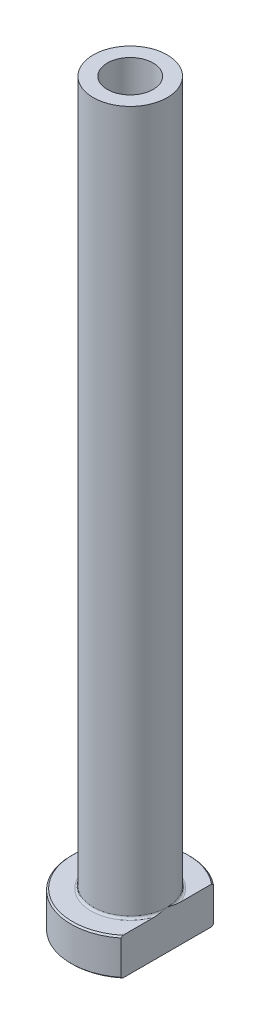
ISO-10303-21;
HEADER;
FILE_DESCRIPTION(('STEP AP214'),'2;1');
FILE_NAME('part.step','',(''),(''),'','','');
FILE_SCHEMA(('AUTOMOTIVE_DESIGN { 1 0 10303 214 1 1 1 1 }'));
ENDSEC;
DATA;
#1=APPLICATION_CONTEXT('core data for automotive mechanical design processes');
#2=APPLICATION_PROTOCOL_DEFINITION('international standard','automotive_design',2000,#1);
#3=PRODUCT_CONTEXT('',#1,'mechanical');
#4=PRODUCT('Part','Part','',(#3));
#5=PRODUCT_RELATED_PRODUCT_CATEGORY('part','',(#4));
#6=PRODUCT_DEFINITION_FORMATION('','',#4);
#7=PRODUCT_DEFINITION_CONTEXT('part definition',#1,'design');
#8=PRODUCT_DEFINITION('design','',#6,#7);
#9=PRODUCT_DEFINITION_SHAPE('','',#8);
#10=(LENGTH_UNIT() NAMED_UNIT(*) SI_UNIT(.MILLI.,.METRE.));
#11=(NAMED_UNIT(*) PLANE_ANGLE_UNIT() SI_UNIT($,.RADIAN.));
#12=(NAMED_UNIT(*) SI_UNIT($,.STERADIAN.) SOLID_ANGLE_UNIT());
#13=UNCERTAINTY_MEASURE_WITH_UNIT(LENGTH_MEASURE(1.E-05),#10,'distance_accuracy_value','');
#14=(GEOMETRIC_REPRESENTATION_CONTEXT(3) GLOBAL_UNCERTAINTY_ASSIGNED_CONTEXT((#13)) GLOBAL_UNIT_ASSIGNED_CONTEXT((#10,
#11,#12)) REPRESENTATION_CONTEXT('',''));
#15=CARTESIAN_POINT('',(0.,0.,0.));
#16=DIRECTION('',(0.,0.,1.));
#17=DIRECTION('',(1.,0.,0.));
#18=AXIS2_PLACEMENT_3D('',#15,#16,#17);
#19=CARTESIAN_POINT('',(0.,92.1876809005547,0.));
#20=DIRECTION('',(0.,1.,0.));
#21=DIRECTION('',(0.,0.,1.));
#22=AXIS2_PLACEMENT_3D('',#19,#20,#21);
#23=CYLINDRICAL_SURFACE('',#22,3.09999999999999);
#24=CARTESIAN_POINT('',(0.,100.,0.));
#25=DIRECTION('',(0.,1.,0.));
#26=DIRECTION('',(0.,0.,1.));
#27=AXIS2_PLACEMENT_3D('',#24,#25,#26);
#28=CIRCLE('',#27,3.09999999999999);
#29=CARTESIAN_POINT('',(0.,100.,3.09999999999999));
#30=VERTEX_POINT('',#29);
#31=EDGE_CURVE('E167',#30,#30,#28,.T.);
#32=ORIENTED_EDGE('',*,*,#31,.T.);
#33=EDGE_LOOP('',(#32));
#34=FACE_BOUND('',#33,.T.);
#35=CARTESIAN_POINT('',(0.,55.,0.));
#36=DIRECTION('',(0.,1.,0.));
#37=DIRECTION('',(0.,0.,1.));
#38=AXIS2_PLACEMENT_3D('',#35,#36,#37);
#39=CIRCLE('',#38,3.09999999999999);
#40=CARTESIAN_POINT('',(0.,55.,3.09999999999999));
#41=VERTEX_POINT('',#40);
#42=EDGE_CURVE('E170',#41,#41,#39,.T.);
#43=ORIENTED_EDGE('',*,*,#42,.F.);
#44=EDGE_LOOP('',(#43));
#45=FACE_BOUND('',#44,.T.);
#46=ADVANCED_FACE('F32',(#34,#45),#23,.F.);
#47=CARTESIAN_POINT('',(-3.09999999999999,100.,0.));
#48=DIRECTION('',(0.,1.,0.));
#49=DIRECTION('',(0.,0.,1.));
#50=AXIS2_PLACEMENT_3D('',#47,#48,#49);
#51=PLANE('',#50);
#52=CARTESIAN_POINT('',(0.,100.,0.));
#53=DIRECTION('',(0.,1.,0.));
#54=DIRECTION('',(0.,0.,1.));
#55=AXIS2_PLACEMENT_3D('',#52,#53,#54);
#56=CIRCLE('',#55,5.);
#57=CARTESIAN_POINT('',(0.,100.,5.));
#58=VERTEX_POINT('',#57);
#59=EDGE_CURVE('E174',#58,#58,#56,.T.);
#60=ORIENTED_EDGE('',*,*,#59,.T.);
#61=EDGE_LOOP('',(#60));
#62=FACE_BOUND('',#61,.T.);
#63=ORIENTED_EDGE('',*,*,#31,.F.);
#64=EDGE_LOOP('',(#63));
#65=FACE_BOUND('',#64,.T.);
#66=ADVANCED_FACE('F157',(#62,#65),#51,.T.);
#67=CARTESIAN_POINT('',(0.,92.1876809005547,0.));
#68=DIRECTION('',(0.,1.,0.));
#69=DIRECTION('',(0.,0.,1.));
#70=AXIS2_PLACEMENT_3D('',#67,#68,#69);
#71=CYLINDRICAL_SURFACE('',#70,5.);
#72=CARTESIAN_POINT('',(0.,5.3,0.));
#73=DIRECTION('',(0.,1.,0.));
#74=DIRECTION('',(0.,0.,1.));
#75=AXIS2_PLACEMENT_3D('',#72,#73,#74);
#76=CIRCLE('',#75,5.);
#77=CARTESIAN_POINT('',(5.,5.3,0.));
#78=VERTEX_POINT('',#77);
#79=EDGE_CURVE('E180',#78,#78,#76,.T.);
#80=ORIENTED_EDGE('',*,*,#79,.T.);
#81=EDGE_LOOP('',(#80));
#82=FACE_BOUND('',#81,.T.);
#83=ORIENTED_EDGE('',*,*,#59,.F.);
#84=EDGE_LOOP('',(#83));
#85=FACE_BOUND('',#84,.T.);
#86=ADVANCED_FACE('F162',(#82,#85),#71,.T.);
#87=CARTESIAN_POINT('',(-4.99999999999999,5.,0.));
#88=DIRECTION('',(0.,1.,0.));
#89=DIRECTION('',(0.,0.,1.));
#90=AXIS2_PLACEMENT_3D('',#87,#88,#89);
#91=PLANE('',#90);
#92=DIRECTION('',(0.,0.,1.));
#93=VECTOR('',#92,1.);
#94=CARTESIAN_POINT('',(5.,5.,0.));
#95=LINE('',#94,#93);
#96=CARTESIAN_POINT('',(5.,5.,-5.98665181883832));
#97=VERTEX_POINT('',#96);
#98=CARTESIAN_POINT('',(5.,5.,-1.75783958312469));
#99=VERTEX_POINT('',#98);
#100=EDGE_CURVE('E54',#97,#99,#95,.T.);
#101=ORIENTED_EDGE('',*,*,#100,.F.);
#102=CARTESIAN_POINT('',(0.,5.,0.));
#103=DIRECTION('',(0.,1.,0.));
#104=DIRECTION('',(0.,0.,1.));
#105=AXIS2_PLACEMENT_3D('',#102,#103,#104);
#106=CIRCLE('',#105,7.80000000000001);
#107=CARTESIAN_POINT('',(4.99999999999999,5.,5.98665181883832));
#108=VERTEX_POINT('',#107);
#109=EDGE_CURVE('E186',#97,#108,#106,.T.);
#110=ORIENTED_EDGE('',*,*,#109,.T.);
#111=CARTESIAN_POINT('',(5.,5.,1.75783958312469));
#112=VERTEX_POINT('',#111);
#113=EDGE_CURVE('E134',#112,#108,#95,.T.);
#114=ORIENTED_EDGE('',*,*,#113,.F.);
#115=CARTESIAN_POINT('',(0.,5.,0.));
#116=DIRECTION('',(0.,1.,0.));
#117=DIRECTION('',(0.,0.,1.));
#118=AXIS2_PLACEMENT_3D('',#115,#116,#117);
#119=CIRCLE('',#118,5.3);
#120=EDGE_CURVE('E183',#112,#99,#119,.F.);
#121=ORIENTED_EDGE('',*,*,#120,.T.);
#122=EDGE_LOOP('',(#101,#110,#114,#121));
#123=FACE_BOUND('',#122,.T.);
#124=ADVANCED_FACE('F197',(#123),#91,.T.);
#125=CARTESIAN_POINT('',(0.,92.1876809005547,0.));
#126=DIRECTION('',(0.,1.,0.));
#127=DIRECTION('',(0.,0.,1.));
#128=AXIS2_PLACEMENT_3D('',#125,#126,#127);
#129=CYLINDRICAL_SURFACE('',#128,7.99999999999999);
#130=DIRECTION('',(0.,-1.,0.));
#131=VECTOR('',#130,1.);
#132=CARTESIAN_POINT('',(4.99999999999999,100.,6.24499799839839));
#133=LINE('',#132,#131);
#134=CARTESIAN_POINT('',(4.99999999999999,4.80000000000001,6.24499799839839));
#135=VERTEX_POINT('',#134);
#136=CARTESIAN_POINT('',(4.99999999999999,0.200000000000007,6.24499799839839));
#137=VERTEX_POINT('',#136);
#138=EDGE_CURVE('E82',#135,#137,#133,.T.);
#139=ORIENTED_EDGE('',*,*,#138,.F.);
#140=CARTESIAN_POINT('',(0.,4.80000000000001,0.));
#141=DIRECTION('',(0.,1.,0.));
#142=DIRECTION('',(0.,0.,1.));
#143=AXIS2_PLACEMENT_3D('',#140,#141,#142);
#144=CIRCLE('',#143,7.99999999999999);
#145=CARTESIAN_POINT('',(5.,4.80000000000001,-6.24499799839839));
#146=VERTEX_POINT('',#145);
#147=EDGE_CURVE('E95',#135,#146,#144,.F.);
#148=ORIENTED_EDGE('',*,*,#147,.T.);
#149=DIRECTION('',(0.,-1.,0.));
#150=VECTOR('',#149,1.);
#151=CARTESIAN_POINT('',(5.,100.,-6.24499799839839));
#152=LINE('',#151,#150);
#153=CARTESIAN_POINT('',(5.,0.200000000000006,-6.24499799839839));
#154=VERTEX_POINT('',#153);
#155=EDGE_CURVE('E192',#146,#154,#152,.T.);
#156=ORIENTED_EDGE('',*,*,#155,.T.);
#157=CARTESIAN_POINT('',(0.,0.200000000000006,0.));
#158=DIRECTION('',(0.,-1.,0.));
#159=DIRECTION('',(0.,0.,-1.));
#160=AXIS2_PLACEMENT_3D('',#157,#158,#159);
#161=CIRCLE('',#160,7.99999999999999);
#162=EDGE_CURVE('E98',#154,#137,#161,.F.);
#163=ORIENTED_EDGE('',*,*,#162,.T.);
#164=EDGE_LOOP('',(#139,#148,#156,#163));
#165=FACE_BOUND('',#164,.T.);
#166=ADVANCED_FACE('F190',(#165),#129,.T.);
#167=CARTESIAN_POINT('',(-7.99999999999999,0.,0.));
#168=DIRECTION('',(0.,-1.,0.));
#169=DIRECTION('',(0.,0.,-1.));
#170=AXIS2_PLACEMENT_3D('',#167,#168,#169);
#171=PLANE('',#170);
#172=CARTESIAN_POINT('',(0.,0.,0.));
#173=DIRECTION('',(0.,-1.,0.));
#174=DIRECTION('',(0.,0.,-1.));
#175=AXIS2_PLACEMENT_3D('',#172,#173,#174);
#176=CIRCLE('',#175,3.84999999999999);
#177=CARTESIAN_POINT('',(0.,0.,-3.84999999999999));
#178=VERTEX_POINT('',#177);
#179=EDGE_CURVE('E40',#178,#178,#176,.F.);
#180=ORIENTED_EDGE('',*,*,#179,.T.);
#181=EDGE_LOOP('',(#180));
#182=FACE_BOUND('',#181,.T.);
#183=DIRECTION('',(0.,0.,-1.));
#184=VECTOR('',#183,1.);
#185=CARTESIAN_POINT('',(4.99999999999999,0.,6.24499799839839));
#186=LINE('',#185,#184);
#187=CARTESIAN_POINT('',(4.99999999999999,0.,5.9866518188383));
#188=VERTEX_POINT('',#187);
#189=CARTESIAN_POINT('',(5.,0.,-5.98665181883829));
#190=VERTEX_POINT('',#189);
#191=EDGE_CURVE('E47',#188,#190,#186,.T.);
#192=ORIENTED_EDGE('',*,*,#191,.F.);
#193=CARTESIAN_POINT('',(0.,0.,0.));
#194=DIRECTION('',(0.,-1.,0.));
#195=DIRECTION('',(0.,0.,-1.));
#196=AXIS2_PLACEMENT_3D('',#193,#194,#195);
#197=CIRCLE('',#196,7.79999999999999);
#198=EDGE_CURVE('E92',#188,#190,#197,.T.);
#199=ORIENTED_EDGE('',*,*,#198,.T.);
#200=EDGE_LOOP('',(#192,#199));
#201=FACE_BOUND('',#200,.T.);
#202=ADVANCED_FACE('F91',(#182,#201),#171,.T.);
#203=CARTESIAN_POINT('',(0.,92.1876809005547,0.));
#204=DIRECTION('',(0.,1.,0.));
#205=DIRECTION('',(0.,0.,1.));
#206=AXIS2_PLACEMENT_3D('',#203,#204,#205);
#207=CYLINDRICAL_SURFACE('',#206,3.34999999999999);
#208=CARTESIAN_POINT('',(0.,0.5,0.));
#209=DIRECTION('',(0.,-1.,0.));
#210=DIRECTION('',(0.,0.,-1.));
#211=AXIS2_PLACEMENT_3D('',#208,#209,#210);
#212=CIRCLE('',#211,3.34999999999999);
#213=CARTESIAN_POINT('',(0.,0.5,-3.34999999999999));
#214=VERTEX_POINT('',#213);
#215=EDGE_CURVE('E11',#214,#214,#212,.T.);
#216=ORIENTED_EDGE('',*,*,#215,.T.);
#217=EDGE_LOOP('',(#216));
#218=FACE_BOUND('',#217,.T.);
#219=CARTESIAN_POINT('',(0.,43.,0.));
#220=DIRECTION('',(0.,1.,0.));
#221=DIRECTION('',(0.,0.,1.));
#222=AXIS2_PLACEMENT_3D('',#219,#220,#221);
#223=CIRCLE('',#222,3.35);
#224=CARTESIAN_POINT('',(0.,43.,3.35));
#225=VERTEX_POINT('',#224);
#226=EDGE_CURVE('E172',#225,#225,#223,.T.);
#227=ORIENTED_EDGE('',*,*,#226,.T.);
#228=EDGE_LOOP('',(#227));
#229=FACE_BOUND('',#228,.T.);
#230=ADVANCED_FACE('F215',(#218,#229),#207,.F.);
#231=CARTESIAN_POINT('',(0.,43.,0.));
#232=DIRECTION('',(0.,-1.,0.));
#233=DIRECTION('',(0.,0.,-1.));
#234=AXIS2_PLACEMENT_3D('',#231,#232,#233);
#235=CONICAL_SURFACE('',#234,3.35,0.0208303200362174);
#236=ORIENTED_EDGE('',*,*,#42,.T.);
#237=EDGE_LOOP('',(#236));
#238=FACE_BOUND('',#237,.T.);
#239=ORIENTED_EDGE('',*,*,#226,.F.);
#240=EDGE_LOOP('',(#239));
#241=FACE_BOUND('',#240,.T.);
#242=ADVANCED_FACE('F111',(#238,#241),#235,.F.);
#243=CARTESIAN_POINT('',(0.,5.3,0.));
#244=DIRECTION('',(0.,1.,0.));
#245=DIRECTION('',(0.,0.,1.));
#246=AXIS2_PLACEMENT_3D('',#243,#244,#245);
#247=TOROIDAL_SURFACE('',#246,5.3,0.3);
#248=ORIENTED_EDGE('',*,*,#120,.F.);
#249=CARTESIAN_POINT('',(5.,5.3,0.));
#250=CARTESIAN_POINT('',(5.,5.30000062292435,-1.31469035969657E-10));
#251=CARTESIAN_POINT('',(5.,5.30000124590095,2.52759224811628E-07));
#252=CARTESIAN_POINT('',(5.,5.30000240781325,9.47164356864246E-07));
#253=CARTESIAN_POINT('',(5.,5.30000293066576,1.40594039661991E-06));
#254=CARTESIAN_POINT('',(5.,5.30000402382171,2.50637608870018E-06));
#255=CARTESIAN_POINT('',(5.,5.30000457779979,3.1658891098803E-06));
#256=CARTESIAN_POINT('',(5.,5.30000556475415,4.52859968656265E-06));
#257=CARTESIAN_POINT('',(5.,5.30000600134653,5.22939450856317E-06));
#258=CARTESIAN_POINT('',(5.,5.30000763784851,7.96121989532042E-06));
#259=CARTESIAN_POINT('',(5.,5.30000875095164,1.00477409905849E-05));
#260=CARTESIAN_POINT('',(5.,5.30001056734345,1.41660874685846E-05));
#261=CARTESIAN_POINT('',(5.,5.30001129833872,1.61861784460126E-05));
#262=CARTESIAN_POINT('',(5.,5.3000143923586,2.47865742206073E-05));
#263=CARTESIAN_POINT('',(5.,5.30001672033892,3.13830284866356E-05));
#264=CARTESIAN_POINT('',(5.,5.3000201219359,4.38084221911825E-05));
#265=CARTESIAN_POINT('',(5.,5.30002133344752,4.95992740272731E-05));
#266=CARTESIAN_POINT('',(5.,5.30003020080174,9.27862615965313E-05));
#267=CARTESIAN_POINT('',(5.,5.30003696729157,0.000130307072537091));
#268=CARTESIAN_POINT('',(5.,5.30006659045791,0.000278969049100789));
#269=CARTESIAN_POINT('',(5.,5.30009481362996,0.000389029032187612));
#270=CARTESIAN_POINT('',(5.,5.30020506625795,0.000826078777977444));
#271=CARTESIAN_POINT('',(5.,5.30028365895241,0.00115365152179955));
#272=CARTESIAN_POINT('',(5.,5.30059919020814,0.00245925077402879));
#273=CARTESIAN_POINT('',(5.,5.3008404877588,0.00343651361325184));
#274=CARTESIAN_POINT('',(5.,5.30184626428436,0.00752058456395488));
#275=CARTESIAN_POINT('',(5.,5.30260525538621,0.0106283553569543));
#276=CARTESIAN_POINT('',(5.,5.30996461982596,0.0407482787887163));
#277=CARTESIAN_POINT('',(5.,5.3165898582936,0.0677561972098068));
#278=CARTESIAN_POINT('',(5.,5.32953319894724,0.120688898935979));
#279=CARTESIAN_POINT('',(5.,5.33585289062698,0.146613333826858));
#280=CARTESIAN_POINT('',(5.,5.34926050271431,0.201795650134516));
#281=CARTESIAN_POINT('',(5.,5.35634306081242,0.231054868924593));
#282=CARTESIAN_POINT('',(5.,5.37050252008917,0.289917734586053));
#283=CARTESIAN_POINT('',(5.,5.37757848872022,0.319521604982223));
#284=CARTESIAN_POINT('',(5.,5.39452602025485,0.391032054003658));
#285=CARTESIAN_POINT('',(5.,5.40434071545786,0.432952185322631));
#286=CARTESIAN_POINT('',(5.,5.42340141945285,0.515763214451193));
#287=CARTESIAN_POINT('',(5.,5.4326555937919,0.556652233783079));
#288=CARTESIAN_POINT('',(5.,5.4571055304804,0.667075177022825));
#289=CARTESIAN_POINT('',(5.,5.47194176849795,0.736689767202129));
#290=CARTESIAN_POINT('',(5.,5.50018229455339,0.876836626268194));
#291=CARTESIAN_POINT('',(5.,5.51357312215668,0.947371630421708));
#292=CARTESIAN_POINT('',(5.,5.5393092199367,1.09497328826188));
#293=CARTESIAN_POINT('',(5.,5.5514621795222,1.17207432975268));
#294=CARTESIAN_POINT('',(5.,5.57239669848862,1.32672649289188));
#295=CARTESIAN_POINT('',(5.,5.58117877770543,1.40427754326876));
#296=CARTESIAN_POINT('',(5.,5.59499725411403,1.56873827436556));
#297=CARTESIAN_POINT('',(5.,5.59948802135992,1.65570044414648));
#298=CARTESIAN_POINT('',(5.,5.60018885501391,1.78535304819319));
#299=CARTESIAN_POINT('',(5.,5.59945214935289,1.82802575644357));
#300=CARTESIAN_POINT('',(5.,5.59559364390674,1.91325081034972));
#301=CARTESIAN_POINT('',(5.,5.59247319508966,1.95580321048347));
#302=CARTESIAN_POINT('',(5.,5.58383242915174,2.03512365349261));
#303=CARTESIAN_POINT('',(5.,5.57867386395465,2.07192937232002));
#304=CARTESIAN_POINT('',(5.,5.56543793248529,2.14526756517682));
#305=CARTESIAN_POINT('',(5.,5.55734203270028,2.18179676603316));
#306=CARTESIAN_POINT('',(5.,5.53718005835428,2.25427226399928));
#307=CARTESIAN_POINT('',(5.,5.52507057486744,2.29020746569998));
#308=CARTESIAN_POINT('',(5.,5.50270928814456,2.34223029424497));
#309=CARTESIAN_POINT('',(5.,5.4945781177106,2.35922314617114));
#310=CARTESIAN_POINT('',(5.,5.47657809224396,2.39224900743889));
#311=CARTESIAN_POINT('',(5.,5.46671281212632,2.40828390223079));
#312=CARTESIAN_POINT('',(5.,5.446958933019,2.43579467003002));
#313=CARTESIAN_POINT('',(5.,5.43745879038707,2.4475459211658));
#314=CARTESIAN_POINT('',(5.,5.41677914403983,2.46946476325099));
#315=CARTESIAN_POINT('',(5.,5.40560543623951,2.47963758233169));
#316=CARTESIAN_POINT('',(5.,5.38617750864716,2.49393642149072));
#317=CARTESIAN_POINT('',(5.,5.37851643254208,2.49886271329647));
#318=CARTESIAN_POINT('',(5.,5.36252740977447,2.50749953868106));
#319=CARTESIAN_POINT('',(5.,5.35419984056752,2.51121075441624));
#320=CARTESIAN_POINT('',(5.,5.33690648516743,2.51712941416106));
#321=CARTESIAN_POINT('',(5.,5.32793451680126,2.5193192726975));
#322=CARTESIAN_POINT('',(5.,5.30973576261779,2.52185978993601));
#323=CARTESIAN_POINT('',(5.,5.30050931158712,2.52221275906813));
#324=CARTESIAN_POINT('',(5.,5.28349166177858,2.52112455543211));
#325=CARTESIAN_POINT('',(5.,5.27568322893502,2.51993178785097));
#326=CARTESIAN_POINT('',(5.,5.26036860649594,2.51628294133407));
#327=CARTESIAN_POINT('',(5.,5.25286261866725,2.5138260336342));
#328=CARTESIAN_POINT('',(5.,5.23590266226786,2.50685484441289));
#329=CARTESIAN_POINT('',(5.,5.22661875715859,2.5019298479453));
#330=CARTESIAN_POINT('',(5.,5.2089551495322,2.49066548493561));
#331=CARTESIAN_POINT('',(5.,5.20057756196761,2.4843229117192));
#332=CARTESIAN_POINT('',(5.,5.17987008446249,2.46645212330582));
#333=CARTESIAN_POINT('',(5.,5.16824151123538,2.45411867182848));
#334=CARTESIAN_POINT('',(5.,5.14692461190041,2.42790849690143));
#335=CARTESIAN_POINT('',(5.,5.13723987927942,2.41402898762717));
#336=CARTESIAN_POINT('',(5.,5.11080706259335,2.37143175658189));
#337=CARTESIAN_POINT('',(5.,5.09628770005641,2.34134703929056));
#338=CARTESIAN_POINT('',(5.,5.07130349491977,2.27940731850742));
#339=CARTESIAN_POINT('',(5.,5.06087110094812,2.24754035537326));
#340=CARTESIAN_POINT('',(5.,5.03890359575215,2.1678724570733));
#341=CARTESIAN_POINT('',(5.,5.0291352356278,2.11959065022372));
#342=CARTESIAN_POINT('',(5.,5.01416953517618,2.02224928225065));
#343=CARTESIAN_POINT('',(5.,5.00898637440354,1.97318778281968));
#344=CARTESIAN_POINT('',(5.,5.00220823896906,1.87635767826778));
#345=CARTESIAN_POINT('',(5.,5.00050709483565,1.82859609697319));
#346=CARTESIAN_POINT('',(5.,4.99969104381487,1.7333016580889));
#347=CARTESIAN_POINT('',(5.,5.00056327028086,1.68576884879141));
#348=CARTESIAN_POINT('',(5.,5.00484296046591,1.57937770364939));
#349=CARTESIAN_POINT('',(5.,5.00880932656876,1.52054285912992));
#350=CARTESIAN_POINT('',(5.,5.01925964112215,1.40312974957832));
#351=CARTESIAN_POINT('',(5.,5.02574264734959,1.34455139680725));
#352=CARTESIAN_POINT('',(5.,5.04090087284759,1.22627662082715));
#353=CARTESIAN_POINT('',(5.,5.04962425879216,1.16658647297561));
#354=CARTESIAN_POINT('',(5.,5.06877923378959,1.04732463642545));
#355=CARTESIAN_POINT('',(5.,5.07921523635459,0.987753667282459));
#356=CARTESIAN_POINT('',(5.,5.10551698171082,0.846936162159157));
#357=CARTESIAN_POINT('',(5.,5.12196565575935,0.765799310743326));
#358=CARTESIAN_POINT('',(5.,5.15639716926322,0.604819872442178));
#359=CARTESIAN_POINT('',(5.,5.17436050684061,0.524973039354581));
#360=CARTESIAN_POINT('',(5.,5.20921667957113,0.374726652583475));
#361=CARTESIAN_POINT('',(5.,5.22599388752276,0.304300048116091));
#362=CARTESIAN_POINT('',(5.,5.25191105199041,0.196907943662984));
#363=CARTESIAN_POINT('',(5.,5.26090146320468,0.159905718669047));
#364=CARTESIAN_POINT('',(5.,5.2788185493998,0.0865164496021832));
#365=CARTESIAN_POINT('',(5.,5.28774391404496,0.0501291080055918));
#366=CARTESIAN_POINT('',(5.,5.2973962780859,0.0106218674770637));
#367=CARTESIAN_POINT('',(5.,5.29815688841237,0.00750762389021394));
#368=CARTESIAN_POINT('',(5.,5.29916304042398,0.0034220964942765));
#369=CARTESIAN_POINT('',(5.,5.29940309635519,0.00244985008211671));
#370=CARTESIAN_POINT('',(5.,5.29971711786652,0.00115049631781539));
#371=CARTESIAN_POINT('',(5.,5.29979541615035,0.000824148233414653));
#372=CARTESIAN_POINT('',(5.,5.29990531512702,0.000388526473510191));
#373=CARTESIAN_POINT('',(5.,5.29993348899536,0.000278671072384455));
#374=CARTESIAN_POINT('',(5.,5.29996306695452,0.000130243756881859));
#375=CARTESIAN_POINT('',(5.,5.29996982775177,9.27511380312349E-05));
#376=CARTESIAN_POINT('',(5.,5.29997868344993,4.95929890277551E-05));
#377=CARTESIAN_POINT('',(5.,5.29997989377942,4.38036556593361E-05));
#378=CARTESIAN_POINT('',(5.,5.29998329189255,3.13814186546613E-05));
#379=CARTESIAN_POINT('',(5.,5.29998561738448,2.47865220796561E-05));
#380=CARTESIAN_POINT('',(5.,5.29998870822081,1.61877547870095E-05));
#381=CARTESIAN_POINT('',(5.,5.29998943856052,1.416777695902E-05));
#382=CARTESIAN_POINT('',(5.,5.29999125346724,1.00495531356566E-05));
#383=CARTESIAN_POINT('',(5.,5.29999236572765,7.96302663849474E-06));
#384=CARTESIAN_POINT('',(5.,5.29999400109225,5.23107421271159E-06));
#385=CARTESIAN_POINT('',(5.,5.29999443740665,4.53021037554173E-06));
#386=CARTESIAN_POINT('',(5.,5.29999542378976,3.16731158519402E-06));
#387=CARTESIAN_POINT('',(5.,5.2999959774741,2.5076772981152E-06));
#388=CARTESIAN_POINT('',(5.,5.29999707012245,1.40695881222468E-06));
#389=CARTESIAN_POINT('',(5.,5.2999975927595,9.48032462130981E-07));
#390=CARTESIAN_POINT('',(5.,5.29999875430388,2.53244333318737E-07));
#391=CARTESIAN_POINT('',(5.,5.29999937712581,1.31459837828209E-10));
#392=CARTESIAN_POINT('',(5.,5.3,0.));
#393=B_SPLINE_CURVE_WITH_KNOTS('',3,(#249,#250,#251,#252,#253,#254,#255,#256,#257,#258,#259,
#260,#261,#262,#263,#264,#265,#266,#267,#268,#269,#270,#271,#272,#273,#274,#275,#276,#277,#278,
#279,#280,#281,#282,#283,#284,#285,#286,#287,#288,#289,#290,#291,#292,#293,#294,#295,#296,#297,
#298,#299,#300,#301,#302,#303,#304,#305,#306,#307,#308,#309,#310,#311,#312,#313,#314,#315,#316,
#317,#318,#319,#320,#321,#322,#323,#324,#325,#326,#327,#328,#329,#330,#331,#332,#333,#334,#335,
#336,#337,#338,#339,#340,#341,#342,#343,#344,#345,#346,#347,#348,#349,#350,#351,#352,#353,#354,
#355,#356,#357,#358,#359,#360,#361,#362,#363,#364,#365,#366,#367,#368,#369,#370,#371,#372,#373,
#374,#375,#376,#377,#378,#379,#380,#381,#382,#383,#384,#385,#386,#387,#388,#389,#390,#391,#392),
.UNSPECIFIED.,.T.,.F.,(4,2,2,2,2,2,2,2,2,2,2,2,2,2,2,2,2,2,2,2,2,2,2,2,2,2,2,2,2,2,2,2,2,2,2,2,
2,2,2,2,2,2,2,2,2,2,2,2,2,2,2,2,2,2,2,2,2,2,2,2,2,2,2,2,2,2,2,2,2,2,2,4),(0.,
1.88939299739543E-06,3.98058885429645E-06,6.54818524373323E-06,9.02404341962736E-06,
1.6093874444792E-05,2.25328191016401E-05,4.34843914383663E-05,6.12120190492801E-05,
0.00017562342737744,0.000516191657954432,0.00152710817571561,0.00454656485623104,
0.0141443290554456,0.0975679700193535,0.177619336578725,0.267931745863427,0.359245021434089,
0.488405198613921,0.61417378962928,0.827694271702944,1.04305715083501,1.27715608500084,
1.51121890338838,1.77214751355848,1.90013509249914,2.02805018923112,2.13945459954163,
2.25157451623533,2.36494894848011,2.42139235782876,2.4777207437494,2.52293802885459,
2.56800219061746,2.59524342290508,2.62246933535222,2.65000494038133,2.67750590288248,
2.7010894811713,2.72468854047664,2.75603978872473,2.78746268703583,2.83802806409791,
2.88868607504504,2.98834295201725,3.08877575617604,3.23618650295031,3.38405153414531,
3.52733651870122,3.66990630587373,3.84673903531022,4.02350562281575,4.20444776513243,
4.38586374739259,4.63419556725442,4.87971270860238,5.09690175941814,5.2111388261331,
5.32353360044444,5.3331513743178,5.33615533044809,5.33716246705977,5.33750240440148,
5.33761672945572,5.33763445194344,5.33765539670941,5.33766183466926,5.33766890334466,
5.33767137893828,5.33767394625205,5.33767603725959,5.33767792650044),.UNSPECIFIED.);
#394=EDGE_CURVE('E126',#112,#78,#393,.T.);
#395=ORIENTED_EDGE('',*,*,#394,.T.);
#396=ORIENTED_EDGE('',*,*,#79,.F.);
#397=CARTESIAN_POINT('',(5.,5.3,0.));
#398=CARTESIAN_POINT('',(5.,5.29999937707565,1.31470316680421E-10));
#399=CARTESIAN_POINT('',(5.,5.29999875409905,-2.52759223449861E-07));
#400=CARTESIAN_POINT('',(5.,5.29999759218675,-9.47164355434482E-07));
#401=CARTESIAN_POINT('',(5.,5.29999706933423,-1.4059403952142E-06));
#402=CARTESIAN_POINT('',(5.,5.29999597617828,-2.50637608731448E-06));
#403=CARTESIAN_POINT('',(5.,5.29999542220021,-3.16588910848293E-06));
#404=CARTESIAN_POINT('',(5.,5.29999443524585,-4.52859968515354E-06));
#405=CARTESIAN_POINT('',(5.,5.29999399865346,-5.22939450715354E-06));
#406=CARTESIAN_POINT('',(5.,5.29999236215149,-7.96121989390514E-06));
#407=CARTESIAN_POINT('',(5.,5.29999124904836,-1.00477409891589E-05));
#408=CARTESIAN_POINT('',(5.,5.29998943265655,-1.41660874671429E-05));
#409=CARTESIAN_POINT('',(5.,5.29998870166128,-1.61861784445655E-05));
#410=CARTESIAN_POINT('',(5.,5.2999856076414,-2.47865742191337E-05));
#411=CARTESIAN_POINT('',(5.,5.29998327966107,-3.1383028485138E-05));
#412=CARTESIAN_POINT('',(5.,5.2999798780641,-4.38084221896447E-05));
#413=CARTESIAN_POINT('',(5.,5.29997866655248,-4.95992740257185E-05));
#414=CARTESIAN_POINT('',(5.,5.29996979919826,-9.27862615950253E-05));
#415=CARTESIAN_POINT('',(5.,5.29996303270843,-0.000130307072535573));
#416=CARTESIAN_POINT('',(5.,5.29993340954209,-0.000278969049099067));
#417=CARTESIAN_POINT('',(5.,5.29990518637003,-0.000389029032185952));
#418=CARTESIAN_POINT('',(5.,5.29979493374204,-0.000826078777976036));
#419=CARTESIAN_POINT('',(5.,5.29971634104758,-0.00115365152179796));
#420=CARTESIAN_POINT('',(5.,5.29940080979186,-0.00245925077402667));
#421=CARTESIAN_POINT('',(5.,5.29915951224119,-0.0034365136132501));
#422=CARTESIAN_POINT('',(5.,5.29815373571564,-0.00752058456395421));
#423=CARTESIAN_POINT('',(5.,5.29739474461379,-0.0106283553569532));
#424=CARTESIAN_POINT('',(5.,5.29003538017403,-0.0407482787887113));
#425=CARTESIAN_POINT('',(5.,5.2834101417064,-0.0677561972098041));
#426=CARTESIAN_POINT('',(5.,5.27046680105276,-0.120688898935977));
#427=CARTESIAN_POINT('',(5.,5.26414710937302,-0.146613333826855));
#428=CARTESIAN_POINT('',(5.,5.25073949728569,-0.201795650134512));
#429=CARTESIAN_POINT('',(5.,5.24365693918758,-0.23105486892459));
#430=CARTESIAN_POINT('',(5.,5.22949747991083,-0.28991773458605));
#431=CARTESIAN_POINT('',(5.,5.22242151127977,-0.319521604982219));
#432=CARTESIAN_POINT('',(5.,5.20547397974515,-0.391032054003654));
#433=CARTESIAN_POINT('',(5.,5.19565928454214,-0.432952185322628));
#434=CARTESIAN_POINT('',(5.,5.17659858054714,-0.515763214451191));
#435=CARTESIAN_POINT('',(5.,5.1673444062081,-0.556652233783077));
#436=CARTESIAN_POINT('',(5.,5.1428944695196,-0.667075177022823));
#437=CARTESIAN_POINT('',(5.,5.12805823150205,-0.736689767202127));
#438=CARTESIAN_POINT('',(5.,5.09981770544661,-0.876836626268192));
#439=CARTESIAN_POINT('',(5.,5.08642687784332,-0.947371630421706));
#440=CARTESIAN_POINT('',(5.,5.0606907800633,-1.09497328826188));
#441=CARTESIAN_POINT('',(5.,5.04853782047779,-1.17207432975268));
#442=CARTESIAN_POINT('',(5.,5.02760330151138,-1.32672649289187));
#443=CARTESIAN_POINT('',(5.,5.01882122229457,-1.40427754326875));
#444=CARTESIAN_POINT('',(5.,5.00500274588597,-1.56873827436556));
#445=CARTESIAN_POINT('',(5.,5.00051197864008,-1.65570044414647));
#446=CARTESIAN_POINT('',(5.,4.99981114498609,-1.78535304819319));
#447=CARTESIAN_POINT('',(5.,5.0005478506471,-1.82802575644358));
#448=CARTESIAN_POINT('',(5.,5.00440635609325,-1.91325081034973));
#449=CARTESIAN_POINT('',(5.,5.00752680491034,-1.95580321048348));
#450=CARTESIAN_POINT('',(5.,5.01616757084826,-2.03512365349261));
#451=CARTESIAN_POINT('',(5.,5.02132613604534,-2.07192937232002));
#452=CARTESIAN_POINT('',(5.,5.0345620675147,-2.14526756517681));
#453=CARTESIAN_POINT('',(5.,5.04265796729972,-2.18179676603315));
#454=CARTESIAN_POINT('',(5.,5.06281994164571,-2.25427226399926));
#455=CARTESIAN_POINT('',(5.,5.07492942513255,-2.29020746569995));
#456=CARTESIAN_POINT('',(5.,5.09729071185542,-2.34223029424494));
#457=CARTESIAN_POINT('',(5.,5.10542188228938,-2.3592231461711));
#458=CARTESIAN_POINT('',(5.,5.12342190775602,-2.39224900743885));
#459=CARTESIAN_POINT('',(5.,5.13328718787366,-2.40828390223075));
#460=CARTESIAN_POINT('',(5.,5.15304106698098,-2.43579467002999));
#461=CARTESIAN_POINT('',(5.,5.1625412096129,-2.44754592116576));
#462=CARTESIAN_POINT('',(5.,5.18322085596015,-2.46946476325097));
#463=CARTESIAN_POINT('',(5.,5.19439456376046,-2.47963758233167));
#464=CARTESIAN_POINT('',(5.,5.21382249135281,-2.4939364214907));
#465=CARTESIAN_POINT('',(5.,5.2214835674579,-2.49886271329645));
#466=CARTESIAN_POINT('',(5.,5.2374725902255,-2.50749953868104));
#467=CARTESIAN_POINT('',(5.,5.24580015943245,-2.51121075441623));
#468=CARTESIAN_POINT('',(5.,5.26309351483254,-2.51712941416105));
#469=CARTESIAN_POINT('',(5.,5.27206548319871,-2.5193192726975));
#470=CARTESIAN_POINT('',(5.,5.29026423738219,-2.52185978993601));
#471=CARTESIAN_POINT('',(5.,5.29949068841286,-2.52221275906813));
#472=CARTESIAN_POINT('',(5.,5.3165083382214,-2.52112455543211));
#473=CARTESIAN_POINT('',(5.,5.32431677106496,-2.51993178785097));
#474=CARTESIAN_POINT('',(5.,5.33963139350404,-2.51628294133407));
#475=CARTESIAN_POINT('',(5.,5.34713738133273,-2.51382603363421));
#476=CARTESIAN_POINT('',(5.,5.36409733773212,-2.5068548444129));
#477=CARTESIAN_POINT('',(5.,5.37338124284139,-2.50192984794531));
#478=CARTESIAN_POINT('',(5.,5.39104485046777,-2.49066548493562));
#479=CARTESIAN_POINT('',(5.,5.39942243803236,-2.48432291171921));
#480=CARTESIAN_POINT('',(5.,5.42012991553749,-2.46645212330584));
#481=CARTESIAN_POINT('',(5.,5.4317584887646,-2.45411867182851));
#482=CARTESIAN_POINT('',(5.,5.45307538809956,-2.42790849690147));
#483=CARTESIAN_POINT('',(5.,5.46276012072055,-2.4140289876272));
#484=CARTESIAN_POINT('',(5.,5.48919293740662,-2.37143175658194));
#485=CARTESIAN_POINT('',(5.,5.50371229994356,-2.34134703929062));
#486=CARTESIAN_POINT('',(5.,5.5286965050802,-2.2794073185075));
#487=CARTESIAN_POINT('',(5.,5.53912889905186,-2.24754035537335));
#488=CARTESIAN_POINT('',(5.,5.56109640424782,-2.16787245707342));
#489=CARTESIAN_POINT('',(5.,5.57086476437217,-2.11959065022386));
#490=CARTESIAN_POINT('',(5.,5.5858304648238,-2.02224928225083));
#491=CARTESIAN_POINT('',(5.,5.59101362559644,-1.97318778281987));
#492=CARTESIAN_POINT('',(5.,5.59779176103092,-1.876357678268));
#493=CARTESIAN_POINT('',(5.,5.59949290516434,-1.82859609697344));
#494=CARTESIAN_POINT('',(5.,5.60030895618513,-1.73330165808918));
#495=CARTESIAN_POINT('',(5.,5.59943672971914,-1.68576884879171));
#496=CARTESIAN_POINT('',(5.,5.5951570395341,-1.57937770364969));
#497=CARTESIAN_POINT('',(5.,5.59119067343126,-1.52054285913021));
#498=CARTESIAN_POINT('',(5.,5.58074035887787,-1.40312974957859));
#499=CARTESIAN_POINT('',(5.,5.57425735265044,-1.3445513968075));
#500=CARTESIAN_POINT('',(5.,5.55909912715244,-1.22627662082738));
#501=CARTESIAN_POINT('',(5.,5.55037574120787,-1.16658647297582));
#502=CARTESIAN_POINT('',(5.,5.53122076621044,-1.04732463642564));
#503=CARTESIAN_POINT('',(5.,5.52078476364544,-0.987753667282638));
#504=CARTESIAN_POINT('',(5.,5.4944830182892,-0.846936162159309));
#505=CARTESIAN_POINT('',(5.,5.47803434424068,-0.765799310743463));
#506=CARTESIAN_POINT('',(5.,5.4436028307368,-0.604819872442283));
#507=CARTESIAN_POINT('',(5.,5.42563949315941,-0.524973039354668));
#508=CARTESIAN_POINT('',(5.,5.39078332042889,-0.374726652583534));
#509=CARTESIAN_POINT('',(5.,5.37400611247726,-0.304300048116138));
#510=CARTESIAN_POINT('',(5.,5.34808894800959,-0.196907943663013));
#511=CARTESIAN_POINT('',(5.,5.33909853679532,-0.15990571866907));
#512=CARTESIAN_POINT('',(5.,5.32118145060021,-0.0865164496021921));
#513=CARTESIAN_POINT('',(5.,5.31225608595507,-0.0501291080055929));
#514=CARTESIAN_POINT('',(5.,5.3026037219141,-0.0106218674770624));
#515=CARTESIAN_POINT('',(5.,5.30184311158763,-0.00750762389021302));
#516=CARTESIAN_POINT('',(5.,5.30083695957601,-0.003422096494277));
#517=CARTESIAN_POINT('',(5.,5.30059690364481,-0.00244985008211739));
#518=CARTESIAN_POINT('',(5.,5.30028288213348,-0.00115049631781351));
#519=CARTESIAN_POINT('',(5.,5.30020458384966,-0.000824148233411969));
#520=CARTESIAN_POINT('',(5.,5.30009468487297,-0.000388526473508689));
#521=CARTESIAN_POINT('',(5.,5.30006651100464,-0.000278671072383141));
#522=CARTESIAN_POINT('',(5.,5.30003693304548,-0.000130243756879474));
#523=CARTESIAN_POINT('',(5.,5.30003017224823,-9.27511380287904E-05));
#524=CARTESIAN_POINT('',(5.,5.30002131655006,-4.95929890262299E-05));
#525=CARTESIAN_POINT('',(5.,5.30002010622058,-4.38036556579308E-05));
#526=CARTESIAN_POINT('',(5.,5.30001670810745,-3.13814186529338E-05));
#527=CARTESIAN_POINT('',(5.,5.30001438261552,-2.47865220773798E-05));
#528=CARTESIAN_POINT('',(5.,5.30001129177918,-1.6187754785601E-05));
#529=CARTESIAN_POINT('',(5.,5.30001056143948,-1.41677769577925E-05));
#530=CARTESIAN_POINT('',(5.,5.30000874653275,-1.00495531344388E-05));
#531=CARTESIAN_POINT('',(5.,5.30000763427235,-7.96302663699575E-06));
#532=CARTESIAN_POINT('',(5.,5.30000599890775,-5.23107421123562E-06));
#533=CARTESIAN_POINT('',(5.,5.30000556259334,-4.53021037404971E-06));
#534=CARTESIAN_POINT('',(5.,5.30000457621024,-3.16731158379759E-06));
#535=CARTESIAN_POINT('',(5.,5.30000402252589,-2.50767729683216E-06));
#536=CARTESIAN_POINT('',(5.,5.30000292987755,-1.406958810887E-06));
#537=CARTESIAN_POINT('',(5.,5.3000024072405,-9.48032460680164E-07));
#538=CARTESIAN_POINT('',(5.,5.30000124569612,-2.53244331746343E-07));
#539=CARTESIAN_POINT('',(5.,5.30000062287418,-1.3145834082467E-10));
#540=CARTESIAN_POINT('',(5.,5.3,0.));
#541=B_SPLINE_CURVE_WITH_KNOTS('',3,(#397,#398,#399,#400,#401,#402,#403,#404,#405,#406,#407,
#408,#409,#410,#411,#412,#413,#414,#415,#416,#417,#418,#419,#420,#421,#422,#423,#424,#425,#426,
#427,#428,#429,#430,#431,#432,#433,#434,#435,#436,#437,#438,#439,#440,#441,#442,#443,#444,#445,
#446,#447,#448,#449,#450,#451,#452,#453,#454,#455,#456,#457,#458,#459,#460,#461,#462,#463,#464,
#465,#466,#467,#468,#469,#470,#471,#472,#473,#474,#475,#476,#477,#478,#479,#480,#481,#482,#483,
#484,#485,#486,#487,#488,#489,#490,#491,#492,#493,#494,#495,#496,#497,#498,#499,#500,#501,#502,
#503,#504,#505,#506,#507,#508,#509,#510,#511,#512,#513,#514,#515,#516,#517,#518,#519,#520,#521,
#522,#523,#524,#525,#526,#527,#528,#529,#530,#531,#532,#533,#534,#535,#536,#537,#538,#539,#540),
.UNSPECIFIED.,.T.,.F.,(4,2,2,2,2,2,2,2,2,2,2,2,2,2,2,2,2,2,2,2,2,2,2,2,2,2,2,2,2,2,2,2,2,2,2,2,
2,2,2,2,2,2,2,2,2,2,2,2,2,2,2,2,2,2,2,2,2,2,2,2,2,2,2,2,2,2,2,2,2,2,2,4),(0.,
1.88939299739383E-06,3.9805888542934E-06,6.54818524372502E-06,9.0240434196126E-06,
1.60938744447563E-05,2.25328191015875E-05,4.34843914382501E-05,6.12120190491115E-05,
0.00017562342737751,0.00051619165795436,0.00152710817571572,0.00454656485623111,
0.0141443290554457,0.0975679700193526,0.177619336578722,0.267931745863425,0.359245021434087,
0.48840519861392,0.61417378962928,0.827694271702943,1.04305715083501,1.27715608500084,
1.51121890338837,1.77214751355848,1.90013509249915,2.02805018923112,2.13945459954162,
2.25157451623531,2.36494894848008,2.42139235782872,2.47772074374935,2.52293802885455,
2.56800219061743,2.59524342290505,2.6224693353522,2.65000494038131,2.67750590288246,
2.70108948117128,2.72468854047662,2.75603978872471,2.7874626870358,2.83802806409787,
2.88868607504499,2.98834295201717,3.08877575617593,3.23618650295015,3.38405153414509,
3.52733651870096,3.66990630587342,3.84673903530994,4.0235056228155,4.20444776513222,
4.38586374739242,4.6341955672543,4.8797127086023,5.0969017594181,5.21113882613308,
5.32353360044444,5.3331513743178,5.33615533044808,5.33716246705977,5.33750240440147,
5.33761672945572,5.33763445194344,5.33765539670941,5.33766183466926,5.33766890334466,
5.33767137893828,5.33767394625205,5.33767603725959,5.33767792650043),.UNSPECIFIED.);
#542=EDGE_CURVE('E135',#78,#99,#541,.T.);
#543=ORIENTED_EDGE('',*,*,#542,.T.);
#544=EDGE_LOOP('',(#248,#395,#396,#543));
#545=FACE_BOUND('',#544,.T.);
#546=ADVANCED_FACE('F141',(#545),#247,.F.);
#547=CARTESIAN_POINT('',(0.,5.,0.));
#548=DIRECTION('',(0.,-1.,0.));
#549=DIRECTION('',(0.,0.,-1.));
#550=AXIS2_PLACEMENT_3D('',#547,#548,#549);
#551=CONICAL_SURFACE('',#550,7.8,0.78539816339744);
#552=CARTESIAN_POINT('',(5.,-1.82162423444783,-13.7401563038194));
#553=CARTESIAN_POINT('',(5.,-1.61889813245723,-13.5244204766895));
#554=CARTESIAN_POINT('',(5.,-1.41646387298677,-13.3084101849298));
#555=CARTESIAN_POINT('',(5.,-1.01227657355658,-12.8757508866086));
#556=CARTESIAN_POINT('',(5.,-0.81052353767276,-12.6591018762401));
#557=CARTESIAN_POINT('',(5.,-0.206157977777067,-12.0077661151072));
#558=CARTESIAN_POINT('',(5.,0.195280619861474,-11.5719884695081));
#559=CARTESIAN_POINT('',(5.,1.00388282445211,-10.6856136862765));
#560=CARTESIAN_POINT('',(5.,1.41093902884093,-10.2349182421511));
#561=CARTESIAN_POINT('',(5.,2.01658324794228,-9.55471676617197));
#562=CARTESIAN_POINT('',(5.,2.21758236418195,-9.32735800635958));
#563=CARTESIAN_POINT('',(5.,2.61761142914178,-8.87091599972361));
#564=CARTESIAN_POINT('',(5.,2.81664139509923,-8.64183276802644));
#565=CARTESIAN_POINT('',(5.,3.21217345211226,-8.18170099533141));
#566=CARTESIAN_POINT('',(5.,3.40867681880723,-7.95065355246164));
#567=CARTESIAN_POINT('',(5.,3.79865427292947,-7.4859998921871));
#568=CARTESIAN_POINT('',(5.,3.99212827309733,-7.25239360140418));
#569=CARTESIAN_POINT('',(5.,4.37558160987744,-6.78155890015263));
#570=CARTESIAN_POINT('',(5.,4.56555334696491,-6.54432428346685));
#571=CARTESIAN_POINT('',(5.,4.94042138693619,-6.06589574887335));
#572=CARTESIAN_POINT('',(5.,5.12531810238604,-5.82470215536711));
#573=CARTESIAN_POINT('',(5.,5.48653546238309,-5.33972956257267));
#574=CARTESIAN_POINT('',(5.,5.6629239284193,-5.09600137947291));
#575=CARTESIAN_POINT('',(5.,6.00675382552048,-4.60213647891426));
#576=CARTESIAN_POINT('',(5.,6.17419169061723,-4.35199726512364));
#577=CARTESIAN_POINT('',(5.,6.49592993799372,-3.84445040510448));
#578=CARTESIAN_POINT('',(5.,6.65027272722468,-3.58707012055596));
#579=CARTESIAN_POINT('',(5.,6.86813414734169,-3.19356592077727));
#580=CARTESIAN_POINT('',(5.,6.93845533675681,-3.06120993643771));
#581=CARTESIAN_POINT('',(5.,7.07360441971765,-2.79373319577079));
#582=CARTESIAN_POINT('',(5.,7.13843319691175,-2.65861288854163));
#583=CARTESIAN_POINT('',(5.,7.26869642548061,-2.3693638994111));
#584=CARTESIAN_POINT('',(5.,7.33331212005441,-2.21486278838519));
#585=CARTESIAN_POINT('',(5.,7.45243473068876,-1.9019407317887));
#586=CARTESIAN_POINT('',(5.,7.50694001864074,-1.74351915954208));
#587=CARTESIAN_POINT('',(5.,7.60343746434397,-1.42384276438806));
#588=CARTESIAN_POINT('',(5.,7.64549910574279,-1.26260921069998));
#589=CARTESIAN_POINT('',(5.,7.71543089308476,-0.937062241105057));
#590=CARTESIAN_POINT('',(5.,7.74330266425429,-0.772749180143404));
#591=CARTESIAN_POINT('',(5.,7.78344284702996,-0.439876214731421));
#592=CARTESIAN_POINT('',(5.,7.79548961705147,-0.271289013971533));
#593=CARTESIAN_POINT('',(5.,7.80240809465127,0.066227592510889));
#594=CARTESIAN_POINT('',(5.,7.79728142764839,0.235156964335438));
#595=CARTESIAN_POINT('',(5.,7.77017954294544,0.572209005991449));
#596=CARTESIAN_POINT('',(5.,7.74814735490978,0.740327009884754));
#597=CARTESIAN_POINT('',(5.,7.68863212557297,1.0737984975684));
#598=CARTESIAN_POINT('',(5.,7.65114437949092,1.23915112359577));
#599=CARTESIAN_POINT('',(5.,7.54734433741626,1.62344926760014));
#600=CARTESIAN_POINT('',(5.,7.47553580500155,1.84089917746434));
#601=CARTESIAN_POINT('',(5.,7.31300119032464,2.26856946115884));
#602=CARTESIAN_POINT('',(5.,7.22226460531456,2.47878574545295));
#603=CARTESIAN_POINT('',(5.,7.07492970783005,2.7901406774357));
#604=CARTESIAN_POINT('',(5.,7.02362278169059,2.89384077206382));
#605=CARTESIAN_POINT('',(5.,6.91783840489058,3.09961626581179));
#606=CARTESIAN_POINT('',(4.99999999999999,6.86336091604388,3.20169164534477));
#607=CARTESIAN_POINT('',(4.99999999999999,6.75169048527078,3.40428995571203));
#608=CARTESIAN_POINT('',(4.99999999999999,6.69449856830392,3.50481345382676));
#609=CARTESIAN_POINT('',(4.99999999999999,6.57774196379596,3.70446206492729));
#610=CARTESIAN_POINT('',(4.99999999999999,6.51817739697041,3.80358724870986));
#611=CARTESIAN_POINT('',(4.99999999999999,6.30853654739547,4.14435766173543));
#612=CARTESIAN_POINT('',(4.99999999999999,6.15326588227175,4.38281352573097));
#613=CARTESIAN_POINT('',(4.99999999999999,5.83377190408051,4.85367607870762));
#614=CARTESIAN_POINT('',(4.99999999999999,5.66954595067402,5.08608095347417));
#615=CARTESIAN_POINT('',(4.99999999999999,5.33431698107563,5.54628554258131));
#616=CARTESIAN_POINT('',(4.99999999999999,5.16330740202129,5.77408045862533));
#617=CARTESIAN_POINT('',(4.99999999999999,4.81629923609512,6.22578157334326));
#618=CARTESIAN_POINT('',(4.99999999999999,4.64030119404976,6.44968819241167));
#619=CARTESIAN_POINT('',(4.99999999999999,4.28368615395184,6.8953257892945));
#620=CARTESIAN_POINT('',(4.99999999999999,4.10305289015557,7.11704371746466));
#621=CARTESIAN_POINT('',(4.99999999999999,3.73870710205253,7.55793799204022));
#622=CARTESIAN_POINT('',(4.99999999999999,3.5549945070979,7.77711427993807));
#623=CARTESIAN_POINT('',(4.99999999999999,3.1852108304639,8.21325328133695));
#624=CARTESIAN_POINT('',(4.99999999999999,2.99914113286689,8.43021717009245));
#625=CARTESIAN_POINT('',(4.99999999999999,2.62499812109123,8.86241167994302));
#626=CARTESIAN_POINT('',(4.99999999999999,2.43692478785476,9.0776422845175));
#627=CARTESIAN_POINT('',(4.99999999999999,1.9146340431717,9.67075518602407));
#628=CARTESIAN_POINT('',(4.99999999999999,1.57868086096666,10.0471086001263));
#629=CARTESIAN_POINT('',(4.99999999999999,0.903003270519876,10.7965122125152));
#630=CARTESIAN_POINT('',(4.99999999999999,0.563278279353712,11.169561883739));
#631=CARTESIAN_POINT('',(4.99999999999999,-0.116149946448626,11.9100168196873));
#632=CARTESIAN_POINT('',(4.99999999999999,-0.455830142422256,12.2774432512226));
#633=CARTESIAN_POINT('',(4.99999999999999,-1.13728640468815,13.0102135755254));
#634=CARTESIAN_POINT('',(4.99999999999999,-1.47906204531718,13.3755578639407));
#635=CARTESIAN_POINT('',(4.99999999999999,-1.82162423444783,13.7401563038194));
#636=B_SPLINE_CURVE_WITH_KNOTS('',3,(#552,#553,#554,#555,#556,#557,#558,#559,#560,#561,#562,
#563,#564,#565,#566,#567,#568,#569,#570,#571,#572,#573,#574,#575,#576,#577,#578,#579,#580,#581,
#582,#583,#584,#585,#586,#587,#588,#589,#590,#591,#592,#593,#594,#595,#596,#597,#598,#599,#600,
#601,#602,#603,#604,#605,#606,#607,#608,#609,#610,#611,#612,#613,#614,#615,#616,#617,#618,#619,
#620,#621,#622,#623,#624,#625,#626,#627,#628,#629,#630,#631,#632,#633,#634,#635),.UNSPECIFIED.,
.F.,.F.,(4,2,2,2,2,2,2,2,2,2,2,2,2,2,2,2,2,2,2,2,2,2,2,2,2,2,2,2,2,2,2,2,2,2,2,2,2,2,2,2,2,4),
(0.,0.888120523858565,1.77624635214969,3.55372511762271,5.3755948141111,6.28598924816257,
7.19637570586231,8.10628289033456,9.01621623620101,9.92793449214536,10.8395784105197,
11.7420025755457,12.6447836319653,13.5445196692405,13.9940505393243,14.4435089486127,
14.9456212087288,15.4478142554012,15.9471477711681,16.4464240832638,16.952621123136,
17.458770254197,17.966632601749,18.4746496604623,19.160451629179,19.8466351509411,
20.193687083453,20.5407431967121,20.8876692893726,21.2345777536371,22.087909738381,
22.9414946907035,23.7959266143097,24.6502655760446,25.5081848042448,26.3661237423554,
27.2235803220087,28.0810450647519,29.5944656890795,31.1081235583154,32.60926785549,
34.1101167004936),.UNSPECIFIED.);
#637=EDGE_CURVE('E133',#146,#97,#636,.T.);
#638=ORIENTED_EDGE('',*,*,#637,.F.);
#639=ORIENTED_EDGE('',*,*,#147,.F.);
#640=EDGE_CURVE('E118',#108,#135,#636,.T.);
#641=ORIENTED_EDGE('',*,*,#640,.F.);
#642=ORIENTED_EDGE('',*,*,#109,.F.);
#643=EDGE_LOOP('',(#638,#639,#641,#642));
#644=FACE_BOUND('',#643,.T.);
#645=ADVANCED_FACE('F145',(#644),#551,.T.);
#646=CARTESIAN_POINT('',(0.,0.200000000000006,0.));
#647=DIRECTION('',(0.,1.,0.));
#648=DIRECTION('',(0.,0.,1.));
#649=AXIS2_PLACEMENT_3D('',#646,#647,#648);
#650=CONICAL_SURFACE('',#649,7.99999999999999,0.78539816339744);
#651=CARTESIAN_POINT('',(4.99999999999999,6.82162423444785,13.7401563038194));
#652=CARTESIAN_POINT('',(4.99999999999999,6.61889813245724,13.5244204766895));
#653=CARTESIAN_POINT('',(4.99999999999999,6.41646387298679,13.3084101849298));
#654=CARTESIAN_POINT('',(4.99999999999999,6.0122765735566,12.8757508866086));
#655=CARTESIAN_POINT('',(4.99999999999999,5.81052353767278,12.6591018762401));
#656=CARTESIAN_POINT('',(4.99999999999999,5.20615797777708,12.0077661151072));
#657=CARTESIAN_POINT('',(4.99999999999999,4.80471938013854,11.5719884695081));
#658=CARTESIAN_POINT('',(4.99999999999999,3.9961171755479,10.6856136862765));
#659=CARTESIAN_POINT('',(4.99999999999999,3.58906097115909,10.2349182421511));
#660=CARTESIAN_POINT('',(4.99999999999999,2.98341675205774,9.55471676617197));
#661=CARTESIAN_POINT('',(4.99999999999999,2.78241763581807,9.32735800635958));
#662=CARTESIAN_POINT('',(4.99999999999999,2.38238857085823,8.87091599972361));
#663=CARTESIAN_POINT('',(4.99999999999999,2.18335860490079,8.64183276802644));
#664=CARTESIAN_POINT('',(4.99999999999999,1.78782654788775,8.18170099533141));
#665=CARTESIAN_POINT('',(4.99999999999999,1.59132318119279,7.95065355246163));
#666=CARTESIAN_POINT('',(4.99999999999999,1.20134572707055,7.4859998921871));
#667=CARTESIAN_POINT('',(4.99999999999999,1.00787172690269,7.25239360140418));
#668=CARTESIAN_POINT('',(4.99999999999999,0.624418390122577,6.78155890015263));
#669=CARTESIAN_POINT('',(4.99999999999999,0.434446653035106,6.54432428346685));
#670=CARTESIAN_POINT('',(4.99999999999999,0.0595786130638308,6.06589574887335));
#671=CARTESIAN_POINT('',(4.99999999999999,-0.125318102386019,5.82470215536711));
#672=CARTESIAN_POINT('',(4.99999999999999,-0.486535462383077,5.33972956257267));
#673=CARTESIAN_POINT('',(4.99999999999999,-0.662923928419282,5.09600137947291));
#674=CARTESIAN_POINT('',(4.99999999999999,-1.00675382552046,4.60213647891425));
#675=CARTESIAN_POINT('',(4.99999999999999,-1.17419169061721,4.35199726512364));
#676=CARTESIAN_POINT('',(4.99999999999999,-1.49592993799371,3.84445040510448));
#677=CARTESIAN_POINT('',(4.99999999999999,-1.65027272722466,3.58707012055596));
#678=CARTESIAN_POINT('',(4.99999999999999,-1.86813414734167,3.19356592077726));
#679=CARTESIAN_POINT('',(5.,-1.93845533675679,3.06120993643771));
#680=CARTESIAN_POINT('',(5.,-2.07360441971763,2.79373319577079));
#681=CARTESIAN_POINT('',(5.,-2.13843319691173,2.65861288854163));
#682=CARTESIAN_POINT('',(5.,-2.2686964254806,2.3693638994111));
#683=CARTESIAN_POINT('',(5.,-2.33331212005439,2.21486278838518));
#684=CARTESIAN_POINT('',(5.,-2.45243473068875,1.9019407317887));
#685=CARTESIAN_POINT('',(5.,-2.50694001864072,1.74351915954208));
#686=CARTESIAN_POINT('',(5.,-2.60343746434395,1.42384276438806));
#687=CARTESIAN_POINT('',(5.,-2.64549910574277,1.26260921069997));
#688=CARTESIAN_POINT('',(5.,-2.71543089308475,0.937062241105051));
#689=CARTESIAN_POINT('',(5.,-2.74330266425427,0.772749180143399));
#690=CARTESIAN_POINT('',(5.,-2.78344284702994,0.439876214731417));
#691=CARTESIAN_POINT('',(5.,-2.79548961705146,0.271289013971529));
#692=CARTESIAN_POINT('',(5.,-2.80240809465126,-0.0662275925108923));
#693=CARTESIAN_POINT('',(5.,-2.79728142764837,-0.23515696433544));
#694=CARTESIAN_POINT('',(5.,-2.77017954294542,-0.57220900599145));
#695=CARTESIAN_POINT('',(5.,-2.74814735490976,-0.740327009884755));
#696=CARTESIAN_POINT('',(5.,-2.68863212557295,-1.0737984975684));
#697=CARTESIAN_POINT('',(5.,-2.6511443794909,-1.23915112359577));
#698=CARTESIAN_POINT('',(5.,-2.54734433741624,-1.62344926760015));
#699=CARTESIAN_POINT('',(5.,-2.47553580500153,-1.84089917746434));
#700=CARTESIAN_POINT('',(5.,-2.31300119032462,-2.26856946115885));
#701=CARTESIAN_POINT('',(5.,-2.22226460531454,-2.47878574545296));
#702=CARTESIAN_POINT('',(5.,-2.07492970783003,-2.7901406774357));
#703=CARTESIAN_POINT('',(5.,-2.02362278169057,-2.89384077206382));
#704=CARTESIAN_POINT('',(5.,-1.91783840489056,-3.09961626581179));
#705=CARTESIAN_POINT('',(5.,-1.86336091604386,-3.20169164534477));
#706=CARTESIAN_POINT('',(5.,-1.75169048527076,-3.40428995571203));
#707=CARTESIAN_POINT('',(5.,-1.6944985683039,-3.50481345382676));
#708=CARTESIAN_POINT('',(5.,-1.57774196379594,-3.70446206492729));
#709=CARTESIAN_POINT('',(5.,-1.51817739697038,-3.80358724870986));
#710=CARTESIAN_POINT('',(5.,-1.30853654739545,-4.14435766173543));
#711=CARTESIAN_POINT('',(5.,-1.15326588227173,-4.38281352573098));
#712=CARTESIAN_POINT('',(5.,-0.83377190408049,-4.85367607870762));
#713=CARTESIAN_POINT('',(5.,-0.669545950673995,-5.08608095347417));
#714=CARTESIAN_POINT('',(5.,-0.334316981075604,-5.54628554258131));
#715=CARTESIAN_POINT('',(5.,-0.163307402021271,-5.77408045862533));
#716=CARTESIAN_POINT('',(5.,0.183700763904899,-6.22578157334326));
#717=CARTESIAN_POINT('',(5.,0.359698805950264,-6.44968819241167));
#718=CARTESIAN_POINT('',(5.,0.716313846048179,-6.8953257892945));
#719=CARTESIAN_POINT('',(5.,0.896947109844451,-7.11704371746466));
#720=CARTESIAN_POINT('',(5.,1.26129289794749,-7.55793799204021));
#721=CARTESIAN_POINT('',(5.,1.44500549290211,-7.77711427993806));
#722=CARTESIAN_POINT('',(5.,1.81478916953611,-8.21325328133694));
#723=CARTESIAN_POINT('',(5.,2.00085886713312,-8.43021717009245));
#724=CARTESIAN_POINT('',(5.,2.37500187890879,-8.86241167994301));
#725=CARTESIAN_POINT('',(5.,2.56307521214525,-9.07764228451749));
#726=CARTESIAN_POINT('',(5.,3.08536595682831,-9.67075518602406));
#727=CARTESIAN_POINT('',(5.,3.42131913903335,-10.0471086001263));
#728=CARTESIAN_POINT('',(5.,4.09699672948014,-10.7965122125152));
#729=CARTESIAN_POINT('',(5.,4.4367217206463,-11.169561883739));
#730=CARTESIAN_POINT('',(5.,5.11614994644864,-11.9100168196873));
#731=CARTESIAN_POINT('',(5.,5.45583014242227,-12.2774432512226));
#732=CARTESIAN_POINT('',(5.,6.13728640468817,-13.0102135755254));
#733=CARTESIAN_POINT('',(5.,6.4790620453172,-13.3755578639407));
#734=CARTESIAN_POINT('',(5.,6.82162423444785,-13.7401563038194));
#735=B_SPLINE_CURVE_WITH_KNOTS('',3,(#651,#652,#653,#654,#655,#656,#657,#658,#659,#660,#661,
#662,#663,#664,#665,#666,#667,#668,#669,#670,#671,#672,#673,#674,#675,#676,#677,#678,#679,#680,
#681,#682,#683,#684,#685,#686,#687,#688,#689,#690,#691,#692,#693,#694,#695,#696,#697,#698,#699,
#700,#701,#702,#703,#704,#705,#706,#707,#708,#709,#710,#711,#712,#713,#714,#715,#716,#717,#718,
#719,#720,#721,#722,#723,#724,#725,#726,#727,#728,#729,#730,#731,#732,#733,#734),.UNSPECIFIED.,
.F.,.F.,(4,2,2,2,2,2,2,2,2,2,2,2,2,2,2,2,2,2,2,2,2,2,2,2,2,2,2,2,2,2,2,2,2,2,2,2,2,2,2,2,2,4),
(0.,0.888120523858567,1.77624635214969,3.55372511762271,5.37559481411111,6.28598924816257,
7.19637570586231,8.10628289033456,9.01621623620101,9.92793449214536,10.8395784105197,
11.7420025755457,12.6447836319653,13.5445196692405,13.9940505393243,14.4435089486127,
14.9456212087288,15.4478142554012,15.9471477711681,16.4464240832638,16.952621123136,
17.458770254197,17.9666326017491,18.4746496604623,19.160451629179,19.8466351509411,
20.193687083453,20.5407431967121,20.8876692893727,21.2345777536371,22.087909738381,
22.9414946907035,23.7959266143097,24.6502655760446,25.5081848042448,26.3661237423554,
27.2235803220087,28.0810450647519,29.5944656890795,31.1081235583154,32.60926785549,
34.1101167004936),.UNSPECIFIED.);
#736=EDGE_CURVE('E79',#137,#188,#735,.T.);
#737=ORIENTED_EDGE('',*,*,#736,.F.);
#738=ORIENTED_EDGE('',*,*,#162,.F.);
#739=EDGE_CURVE('E87',#190,#154,#735,.T.);
#740=ORIENTED_EDGE('',*,*,#739,.F.);
#741=ORIENTED_EDGE('',*,*,#198,.F.);
#742=EDGE_LOOP('',(#737,#738,#740,#741));
#743=FACE_BOUND('',#742,.T.);
#744=ADVANCED_FACE('F94',(#743),#650,.T.);
#745=CARTESIAN_POINT('',(4.99999999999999,100.,6.24499799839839));
#746=DIRECTION('',(-1.,0.,0.));
#747=DIRECTION('',(0.,0.,1.));
#748=AXIS2_PLACEMENT_3D('',#745,#746,#747);
#749=PLANE('',#748);
#750=ORIENTED_EDGE('',*,*,#394,.F.);
#751=ORIENTED_EDGE('',*,*,#113,.T.);
#752=ORIENTED_EDGE('',*,*,#640,.T.);
#753=ORIENTED_EDGE('',*,*,#138,.T.);
#754=ORIENTED_EDGE('',*,*,#736,.T.);
#755=ORIENTED_EDGE('',*,*,#191,.T.);
#756=ORIENTED_EDGE('',*,*,#739,.T.);
#757=ORIENTED_EDGE('',*,*,#155,.F.);
#758=ORIENTED_EDGE('',*,*,#637,.T.);
#759=ORIENTED_EDGE('',*,*,#100,.T.);
#760=ORIENTED_EDGE('',*,*,#542,.F.);
#761=EDGE_LOOP('',(#750,#751,#752,#753,#754,#755,#756,#757,#758,#759,#760));
#762=FACE_BOUND('',#761,.T.);
#763=ADVANCED_FACE('F80',(#762),#749,.F.);
#764=CARTESIAN_POINT('',(0.,0.,0.));
#765=DIRECTION('',(0.,-1.,0.));
#766=DIRECTION('',(0.,0.,-1.));
#767=AXIS2_PLACEMENT_3D('',#764,#765,#766);
#768=CONICAL_SURFACE('',#767,3.84999999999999,0.785398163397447);
#769=ORIENTED_EDGE('',*,*,#215,.F.);
#770=EDGE_LOOP('',(#769));
#771=FACE_BOUND('',#770,.T.);
#772=ORIENTED_EDGE('',*,*,#179,.F.);
#773=EDGE_LOOP('',(#772));
#774=FACE_BOUND('',#773,.T.);
#775=ADVANCED_FACE('F34',(#771,#774),#768,.F.);
#776=CLOSED_SHELL('',(#46,#66,#86,#124,#166,#202,#230,#242,#546,#645,#744,#763,#775));
#777=MANIFOLD_SOLID_BREP('B2',#776);
#778=ADVANCED_BREP_SHAPE_REPRESENTATION('',(#18,#777),#14);
#779=SHAPE_DEFINITION_REPRESENTATION(#9,#778);
ENDSEC;
END-ISO-10303-21;
